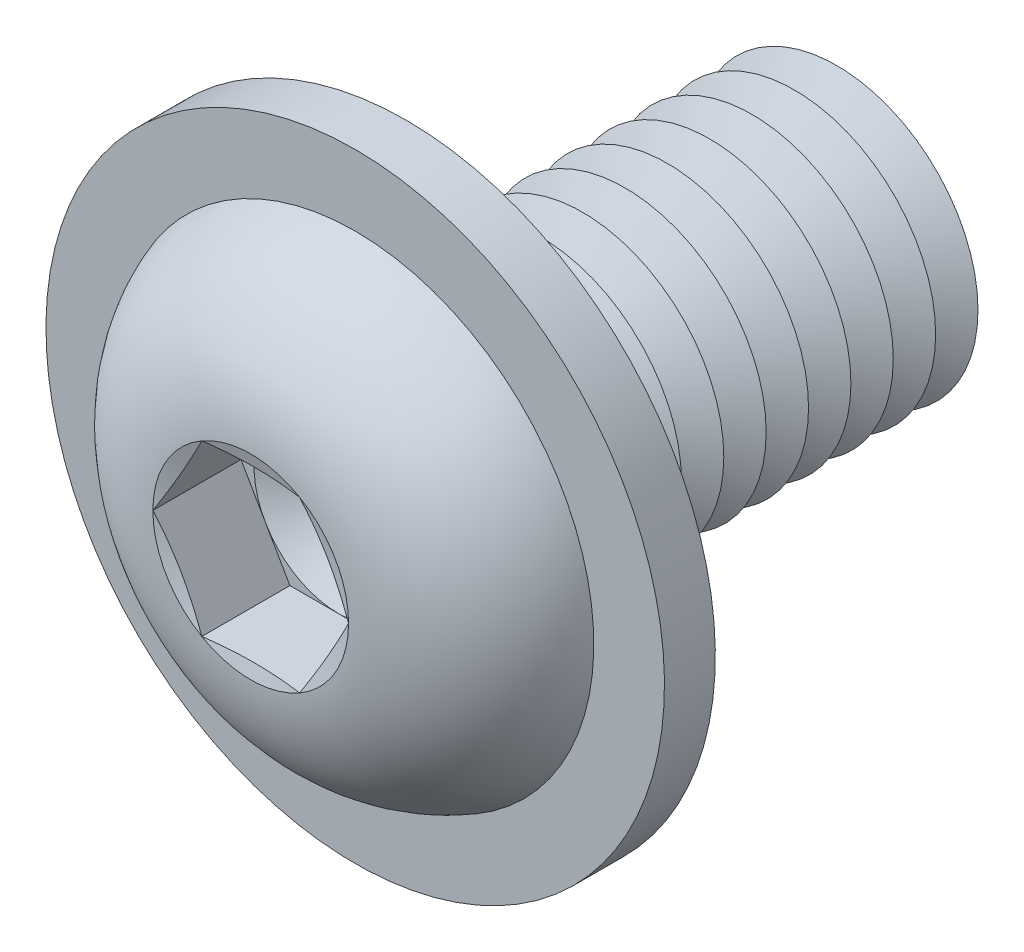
ISO-10303-21;
HEADER;
FILE_DESCRIPTION(('STEP AP214'),'2;1');
FILE_NAME('part.step','',(''),(''),'','','');
FILE_SCHEMA(('AUTOMOTIVE_DESIGN { 1 0 10303 214 1 1 1 1 }'));
ENDSEC;
DATA;
#1=APPLICATION_CONTEXT('core data for automotive mechanical design processes');
#2=APPLICATION_PROTOCOL_DEFINITION('international standard','automotive_design',2000,#1);
#3=PRODUCT_CONTEXT('',#1,'mechanical');
#4=PRODUCT('Part','Part','',(#3));
#5=PRODUCT_RELATED_PRODUCT_CATEGORY('part','',(#4));
#6=PRODUCT_DEFINITION_FORMATION('','',#4);
#7=PRODUCT_DEFINITION_CONTEXT('part definition',#1,'design');
#8=PRODUCT_DEFINITION('design','',#6,#7);
#9=PRODUCT_DEFINITION_SHAPE('','',#8);
#10=(LENGTH_UNIT() NAMED_UNIT(*) SI_UNIT(.MILLI.,.METRE.));
#11=(NAMED_UNIT(*) PLANE_ANGLE_UNIT() SI_UNIT($,.RADIAN.));
#12=(NAMED_UNIT(*) SI_UNIT($,.STERADIAN.) SOLID_ANGLE_UNIT());
#13=UNCERTAINTY_MEASURE_WITH_UNIT(LENGTH_MEASURE(1.E-05),#10,'distance_accuracy_value','');
#14=(GEOMETRIC_REPRESENTATION_CONTEXT(3) GLOBAL_UNCERTAINTY_ASSIGNED_CONTEXT((#13)) GLOBAL_UNIT_ASSIGNED_CONTEXT((#10,
#11,#12)) REPRESENTATION_CONTEXT('',''));
#15=CARTESIAN_POINT('',(0.,0.,0.));
#16=DIRECTION('',(0.,0.,1.));
#17=DIRECTION('',(1.,0.,0.));
#18=AXIS2_PLACEMENT_3D('',#15,#16,#17);
#19=CARTESIAN_POINT('',(0.,0.,-10.75));
#20=DIRECTION('',(0.,0.,1.));
#21=DIRECTION('',(1.,0.,0.));
#22=AXIS2_PLACEMENT_3D('',#19,#20,#21);
#23=CONICAL_SURFACE('',#22,5.,1.0471975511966);
#24=CARTESIAN_POINT('',(0.,0.,-11.5));
#25=DIRECTION('',(0.,0.,1.));
#26=DIRECTION('',(1.,0.,0.));
#27=AXIS2_PLACEMENT_3D('',#24,#25,#26);
#28=CIRCLE('',#27,3.70096189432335);
#29=CARTESIAN_POINT('',(3.70096189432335,0.,-11.5));
#30=VERTEX_POINT('',#29);
#31=EDGE_CURVE('E338',#30,#30,#28,.T.);
#32=ORIENTED_EDGE('',*,*,#31,.T.);
#33=EDGE_LOOP('',(#32));
#34=FACE_BOUND('',#33,.T.);
#35=CARTESIAN_POINT('',(0.,0.,-10.75));
#36=DIRECTION('',(0.,0.,1.));
#37=DIRECTION('',(1.,0.,0.));
#38=AXIS2_PLACEMENT_3D('',#35,#36,#37);
#39=CIRCLE('',#38,5.);
#40=CARTESIAN_POINT('',(5.,0.,-10.75));
#41=VERTEX_POINT('',#40);
#42=EDGE_CURVE('E336',#41,#41,#39,.T.);
#43=ORIENTED_EDGE('',*,*,#42,.F.);
#44=EDGE_LOOP('',(#43));
#45=FACE_BOUND('',#44,.T.);
#46=ADVANCED_FACE('F39',(#34,#45),#23,.T.);
#47=CARTESIAN_POINT('',(0.,0.,-11.5));
#48=DIRECTION('',(0.,0.,-1.));
#49=DIRECTION('',(-1.,0.,0.));
#50=AXIS2_PLACEMENT_3D('',#47,#48,#49);
#51=CONICAL_SURFACE('',#50,3.70096189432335,1.0471975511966);
#52=CARTESIAN_POINT('',(0.,0.,-12.25));
#53=DIRECTION('',(0.,0.,1.));
#54=DIRECTION('',(1.,0.,0.));
#55=AXIS2_PLACEMENT_3D('',#52,#53,#54);
#56=CIRCLE('',#55,5.);
#57=CARTESIAN_POINT('',(5.,0.,-12.25));
#58=VERTEX_POINT('',#57);
#59=EDGE_CURVE('E334',#58,#58,#56,.T.);
#60=ORIENTED_EDGE('',*,*,#59,.T.);
#61=EDGE_LOOP('',(#60));
#62=FACE_BOUND('',#61,.T.);
#63=ORIENTED_EDGE('',*,*,#31,.F.);
#64=EDGE_LOOP('',(#63));
#65=FACE_BOUND('',#64,.T.);
#66=ADVANCED_FACE('F420',(#62,#65),#51,.T.);
#67=CARTESIAN_POINT('',(0.,5.00000000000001,-16.));
#68=DIRECTION('',(0.,0.,-1.));
#69=DIRECTION('',(-1.,0.,0.));
#70=AXIS2_PLACEMENT_3D('',#67,#68,#69);
#71=PLANE('',#70);
#72=CARTESIAN_POINT('',(0.,0.,-16.));
#73=DIRECTION('',(0.,0.,1.));
#74=DIRECTION('',(1.,0.,0.));
#75=AXIS2_PLACEMENT_3D('',#72,#73,#74);
#76=CIRCLE('',#75,3.70096189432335);
#77=CARTESIAN_POINT('',(3.70096189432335,0.,-16.));
#78=VERTEX_POINT('',#77);
#79=EDGE_CURVE('E307',#78,#78,#76,.T.);
#80=ORIENTED_EDGE('',*,*,#79,.F.);
#81=EDGE_LOOP('',(#80));
#82=FACE_BOUND('',#81,.T.);
#83=ADVANCED_FACE('F418',(#82),#71,.T.);
#84=CARTESIAN_POINT('',(0.,0.,-15.25));
#85=DIRECTION('',(0.,0.,1.));
#86=DIRECTION('',(1.,0.,0.));
#87=AXIS2_PLACEMENT_3D('',#84,#85,#86);
#88=CONICAL_SURFACE('',#87,5.,1.0471975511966);
#89=ORIENTED_EDGE('',*,*,#79,.T.);
#90=EDGE_LOOP('',(#89));
#91=FACE_BOUND('',#90,.T.);
#92=CARTESIAN_POINT('',(0.,0.,-15.25));
#93=DIRECTION('',(0.,0.,1.));
#94=DIRECTION('',(1.,0.,0.));
#95=AXIS2_PLACEMENT_3D('',#92,#93,#94);
#96=CIRCLE('',#95,5.);
#97=CARTESIAN_POINT('',(5.,0.,-15.25));
#98=VERTEX_POINT('',#97);
#99=EDGE_CURVE('E354',#98,#98,#96,.T.);
#100=ORIENTED_EDGE('',*,*,#99,.F.);
#101=EDGE_LOOP('',(#100));
#102=FACE_BOUND('',#101,.T.);
#103=ADVANCED_FACE('F415',(#91,#102),#88,.T.);
#104=CARTESIAN_POINT('',(0.,0.,-14.5));
#105=DIRECTION('',(0.,0.,-1.));
#106=DIRECTION('',(-1.,0.,0.));
#107=AXIS2_PLACEMENT_3D('',#104,#105,#106);
#108=CONICAL_SURFACE('',#107,3.70096189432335,1.0471975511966);
#109=ORIENTED_EDGE('',*,*,#99,.T.);
#110=EDGE_LOOP('',(#109));
#111=FACE_BOUND('',#110,.T.);
#112=CARTESIAN_POINT('',(0.,0.,-14.5));
#113=DIRECTION('',(0.,0.,1.));
#114=DIRECTION('',(1.,0.,0.));
#115=AXIS2_PLACEMENT_3D('',#112,#113,#114);
#116=CIRCLE('',#115,3.70096189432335);
#117=CARTESIAN_POINT('',(3.70096189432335,0.,-14.5));
#118=VERTEX_POINT('',#117);
#119=EDGE_CURVE('E351',#118,#118,#116,.T.);
#120=ORIENTED_EDGE('',*,*,#119,.F.);
#121=EDGE_LOOP('',(#120));
#122=FACE_BOUND('',#121,.T.);
#123=ADVANCED_FACE('F425',(#111,#122),#108,.T.);
#124=CARTESIAN_POINT('',(0.,0.,-13.75));
#125=DIRECTION('',(0.,0.,1.));
#126=DIRECTION('',(1.,0.,0.));
#127=AXIS2_PLACEMENT_3D('',#124,#125,#126);
#128=CONICAL_SURFACE('',#127,5.,1.0471975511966);
#129=ORIENTED_EDGE('',*,*,#119,.T.);
#130=EDGE_LOOP('',(#129));
#131=FACE_BOUND('',#130,.T.);
#132=CARTESIAN_POINT('',(0.,0.,-13.75));
#133=DIRECTION('',(0.,0.,1.));
#134=DIRECTION('',(1.,0.,0.));
#135=AXIS2_PLACEMENT_3D('',#132,#133,#134);
#136=CIRCLE('',#135,5.);
#137=CARTESIAN_POINT('',(5.,0.,-13.75));
#138=VERTEX_POINT('',#137);
#139=EDGE_CURVE('E333',#138,#138,#136,.T.);
#140=ORIENTED_EDGE('',*,*,#139,.F.);
#141=EDGE_LOOP('',(#140));
#142=FACE_BOUND('',#141,.T.);
#143=ADVANCED_FACE('F441',(#131,#142),#128,.T.);
#144=CARTESIAN_POINT('',(0.,0.,-13.));
#145=DIRECTION('',(0.,0.,-1.));
#146=DIRECTION('',(-1.,0.,0.));
#147=AXIS2_PLACEMENT_3D('',#144,#145,#146);
#148=CONICAL_SURFACE('',#147,3.70096189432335,1.0471975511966);
#149=ORIENTED_EDGE('',*,*,#139,.T.);
#150=EDGE_LOOP('',(#149));
#151=FACE_BOUND('',#150,.T.);
#152=CARTESIAN_POINT('',(0.,0.,-13.));
#153=DIRECTION('',(0.,0.,1.));
#154=DIRECTION('',(1.,0.,0.));
#155=AXIS2_PLACEMENT_3D('',#152,#153,#154);
#156=CIRCLE('',#155,3.70096189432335);
#157=CARTESIAN_POINT('',(3.70096189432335,0.,-13.));
#158=VERTEX_POINT('',#157);
#159=EDGE_CURVE('E330',#158,#158,#156,.T.);
#160=ORIENTED_EDGE('',*,*,#159,.F.);
#161=EDGE_LOOP('',(#160));
#162=FACE_BOUND('',#161,.T.);
#163=ADVANCED_FACE('F437',(#151,#162),#148,.T.);
#164=CARTESIAN_POINT('',(0.,0.,-12.25));
#165=DIRECTION('',(0.,0.,1.));
#166=DIRECTION('',(1.,0.,0.));
#167=AXIS2_PLACEMENT_3D('',#164,#165,#166);
#168=CONICAL_SURFACE('',#167,5.,1.0471975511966);
#169=ORIENTED_EDGE('',*,*,#159,.T.);
#170=EDGE_LOOP('',(#169));
#171=FACE_BOUND('',#170,.T.);
#172=ORIENTED_EDGE('',*,*,#59,.F.);
#173=EDGE_LOOP('',(#172));
#174=FACE_BOUND('',#173,.T.);
#175=ADVANCED_FACE('F440',(#171,#174),#168,.T.);
#176=CARTESIAN_POINT('',(0.,0.,-9.25));
#177=DIRECTION('',(0.,0.,1.));
#178=DIRECTION('',(1.,0.,0.));
#179=AXIS2_PLACEMENT_3D('',#176,#177,#178);
#180=CONICAL_SURFACE('',#179,5.,1.0471975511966);
#181=CARTESIAN_POINT('',(0.,0.,-10.));
#182=DIRECTION('',(0.,0.,1.));
#183=DIRECTION('',(1.,0.,0.));
#184=AXIS2_PLACEMENT_3D('',#181,#182,#183);
#185=CIRCLE('',#184,3.70096189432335);
#186=CARTESIAN_POINT('',(3.70096189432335,0.,-10.));
#187=VERTEX_POINT('',#186);
#188=EDGE_CURVE('E339',#187,#187,#185,.T.);
#189=ORIENTED_EDGE('',*,*,#188,.T.);
#190=EDGE_LOOP('',(#189));
#191=FACE_BOUND('',#190,.T.);
#192=CARTESIAN_POINT('',(0.,0.,-9.25));
#193=DIRECTION('',(0.,0.,1.));
#194=DIRECTION('',(1.,0.,0.));
#195=AXIS2_PLACEMENT_3D('',#192,#193,#194);
#196=CIRCLE('',#195,5.);
#197=CARTESIAN_POINT('',(5.,0.,-9.25));
#198=VERTEX_POINT('',#197);
#199=EDGE_CURVE('E369',#198,#198,#196,.T.);
#200=ORIENTED_EDGE('',*,*,#199,.F.);
#201=EDGE_LOOP('',(#200));
#202=FACE_BOUND('',#201,.T.);
#203=ADVANCED_FACE('F445',(#191,#202),#180,.T.);
#204=CARTESIAN_POINT('',(0.,0.,-10.));
#205=DIRECTION('',(0.,0.,-1.));
#206=DIRECTION('',(-1.,0.,0.));
#207=AXIS2_PLACEMENT_3D('',#204,#205,#206);
#208=CONICAL_SURFACE('',#207,3.70096189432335,1.0471975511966);
#209=ORIENTED_EDGE('',*,*,#42,.T.);
#210=EDGE_LOOP('',(#209));
#211=FACE_BOUND('',#210,.T.);
#212=ORIENTED_EDGE('',*,*,#188,.F.);
#213=EDGE_LOOP('',(#212));
#214=FACE_BOUND('',#213,.T.);
#215=ADVANCED_FACE('F476',(#211,#214),#208,.T.);
#216=CARTESIAN_POINT('',(0.,0.,-7.75));
#217=DIRECTION('',(0.,0.,1.));
#218=DIRECTION('',(1.,0.,0.));
#219=AXIS2_PLACEMENT_3D('',#216,#217,#218);
#220=CONICAL_SURFACE('',#219,5.,1.0471975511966);
#221=CARTESIAN_POINT('',(0.,0.,-8.5));
#222=DIRECTION('',(0.,0.,1.));
#223=DIRECTION('',(1.,0.,0.));
#224=AXIS2_PLACEMENT_3D('',#221,#222,#223);
#225=CIRCLE('',#224,3.70096189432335);
#226=CARTESIAN_POINT('',(3.70096189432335,0.,-8.5));
#227=VERTEX_POINT('',#226);
#228=EDGE_CURVE('E371',#227,#227,#225,.T.);
#229=ORIENTED_EDGE('',*,*,#228,.T.);
#230=EDGE_LOOP('',(#229));
#231=FACE_BOUND('',#230,.T.);
#232=CARTESIAN_POINT('',(0.,0.,-7.75));
#233=DIRECTION('',(0.,0.,1.));
#234=DIRECTION('',(1.,0.,0.));
#235=AXIS2_PLACEMENT_3D('',#232,#233,#234);
#236=CIRCLE('',#235,5.);
#237=CARTESIAN_POINT('',(5.,0.,-7.75));
#238=VERTEX_POINT('',#237);
#239=EDGE_CURVE('E348',#238,#238,#236,.T.);
#240=ORIENTED_EDGE('',*,*,#239,.F.);
#241=EDGE_LOOP('',(#240));
#242=FACE_BOUND('',#241,.T.);
#243=ADVANCED_FACE('F482',(#231,#242),#220,.T.);
#244=CARTESIAN_POINT('',(0.,0.,-8.5));
#245=DIRECTION('',(0.,0.,-1.));
#246=DIRECTION('',(-1.,0.,0.));
#247=AXIS2_PLACEMENT_3D('',#244,#245,#246);
#248=CONICAL_SURFACE('',#247,3.70096189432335,1.0471975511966);
#249=ORIENTED_EDGE('',*,*,#199,.T.);
#250=EDGE_LOOP('',(#249));
#251=FACE_BOUND('',#250,.T.);
#252=ORIENTED_EDGE('',*,*,#228,.F.);
#253=EDGE_LOOP('',(#252));
#254=FACE_BOUND('',#253,.T.);
#255=ADVANCED_FACE('F489',(#251,#254),#248,.T.);
#256=CARTESIAN_POINT('',(0.,0.,-6.25));
#257=DIRECTION('',(0.,0.,1.));
#258=DIRECTION('',(1.,0.,0.));
#259=AXIS2_PLACEMENT_3D('',#256,#257,#258);
#260=CONICAL_SURFACE('',#259,5.,1.0471975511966);
#261=CARTESIAN_POINT('',(0.,0.,-7.));
#262=DIRECTION('',(0.,0.,1.));
#263=DIRECTION('',(1.,0.,0.));
#264=AXIS2_PLACEMENT_3D('',#261,#262,#263);
#265=CIRCLE('',#264,3.70096189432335);
#266=CARTESIAN_POINT('',(3.70096189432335,0.,-7.));
#267=VERTEX_POINT('',#266);
#268=EDGE_CURVE('E345',#267,#267,#265,.T.);
#269=ORIENTED_EDGE('',*,*,#268,.T.);
#270=EDGE_LOOP('',(#269));
#271=FACE_BOUND('',#270,.T.);
#272=CARTESIAN_POINT('',(0.,0.,-6.25));
#273=DIRECTION('',(0.,0.,1.));
#274=DIRECTION('',(1.,0.,0.));
#275=AXIS2_PLACEMENT_3D('',#272,#273,#274);
#276=CIRCLE('',#275,5.);
#277=CARTESIAN_POINT('',(5.,0.,-6.25));
#278=VERTEX_POINT('',#277);
#279=EDGE_CURVE('E349',#278,#278,#276,.T.);
#280=ORIENTED_EDGE('',*,*,#279,.F.);
#281=EDGE_LOOP('',(#280));
#282=FACE_BOUND('',#281,.T.);
#283=ADVANCED_FACE('F496',(#271,#282),#260,.T.);
#284=CARTESIAN_POINT('',(0.,0.,-7.));
#285=DIRECTION('',(0.,0.,-1.));
#286=DIRECTION('',(-1.,0.,0.));
#287=AXIS2_PLACEMENT_3D('',#284,#285,#286);
#288=CONICAL_SURFACE('',#287,3.70096189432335,1.0471975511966);
#289=ORIENTED_EDGE('',*,*,#239,.T.);
#290=EDGE_LOOP('',(#289));
#291=FACE_BOUND('',#290,.T.);
#292=ORIENTED_EDGE('',*,*,#268,.F.);
#293=EDGE_LOOP('',(#292));
#294=FACE_BOUND('',#293,.T.);
#295=ADVANCED_FACE('F503',(#291,#294),#288,.T.);
#296=CARTESIAN_POINT('',(0.,0.,-4.75));
#297=DIRECTION('',(0.,0.,1.));
#298=DIRECTION('',(1.,0.,0.));
#299=AXIS2_PLACEMENT_3D('',#296,#297,#298);
#300=CONICAL_SURFACE('',#299,5.,1.0471975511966);
#301=CARTESIAN_POINT('',(0.,0.,-5.5));
#302=DIRECTION('',(0.,0.,1.));
#303=DIRECTION('',(1.,0.,0.));
#304=AXIS2_PLACEMENT_3D('',#301,#302,#303);
#305=CIRCLE('',#304,3.70096189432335);
#306=CARTESIAN_POINT('',(3.70096189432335,0.,-5.5));
#307=VERTEX_POINT('',#306);
#308=EDGE_CURVE('E380',#307,#307,#305,.T.);
#309=ORIENTED_EDGE('',*,*,#308,.T.);
#310=EDGE_LOOP('',(#309));
#311=FACE_BOUND('',#310,.T.);
#312=CARTESIAN_POINT('',(0.,0.,-4.75));
#313=DIRECTION('',(0.,0.,1.));
#314=DIRECTION('',(1.,0.,0.));
#315=AXIS2_PLACEMENT_3D('',#312,#313,#314);
#316=CIRCLE('',#315,5.);
#317=CARTESIAN_POINT('',(5.,0.,-4.75));
#318=VERTEX_POINT('',#317);
#319=EDGE_CURVE('E382',#318,#318,#316,.T.);
#320=ORIENTED_EDGE('',*,*,#319,.F.);
#321=EDGE_LOOP('',(#320));
#322=FACE_BOUND('',#321,.T.);
#323=ADVANCED_FACE('F510',(#311,#322),#300,.T.);
#324=CARTESIAN_POINT('',(0.,0.,-5.5));
#325=DIRECTION('',(0.,0.,-1.));
#326=DIRECTION('',(-1.,0.,0.));
#327=AXIS2_PLACEMENT_3D('',#324,#325,#326);
#328=CONICAL_SURFACE('',#327,3.70096189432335,1.0471975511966);
#329=ORIENTED_EDGE('',*,*,#279,.T.);
#330=EDGE_LOOP('',(#329));
#331=FACE_BOUND('',#330,.T.);
#332=ORIENTED_EDGE('',*,*,#308,.F.);
#333=EDGE_LOOP('',(#332));
#334=FACE_BOUND('',#333,.T.);
#335=ADVANCED_FACE('F517',(#331,#334),#328,.T.);
#336=CARTESIAN_POINT('',(0.,0.,-3.25));
#337=DIRECTION('',(0.,0.,1.));
#338=DIRECTION('',(1.,0.,0.));
#339=AXIS2_PLACEMENT_3D('',#336,#337,#338);
#340=CONICAL_SURFACE('',#339,5.,1.0471975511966);
#341=CARTESIAN_POINT('',(0.,0.,-4.));
#342=DIRECTION('',(0.,0.,1.));
#343=DIRECTION('',(1.,0.,0.));
#344=AXIS2_PLACEMENT_3D('',#341,#342,#343);
#345=CIRCLE('',#344,3.70096189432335);
#346=CARTESIAN_POINT('',(3.70096189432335,0.,-4.));
#347=VERTEX_POINT('',#346);
#348=EDGE_CURVE('E390',#347,#347,#345,.T.);
#349=ORIENTED_EDGE('',*,*,#348,.T.);
#350=EDGE_LOOP('',(#349));
#351=FACE_BOUND('',#350,.T.);
#352=CARTESIAN_POINT('',(0.,0.,-3.25));
#353=DIRECTION('',(0.,0.,1.));
#354=DIRECTION('',(1.,0.,0.));
#355=AXIS2_PLACEMENT_3D('',#352,#353,#354);
#356=CIRCLE('',#355,5.);
#357=CARTESIAN_POINT('',(5.,0.,-3.25));
#358=VERTEX_POINT('',#357);
#359=EDGE_CURVE('E358',#358,#358,#356,.T.);
#360=ORIENTED_EDGE('',*,*,#359,.F.);
#361=EDGE_LOOP('',(#360));
#362=FACE_BOUND('',#361,.T.);
#363=ADVANCED_FACE('F523',(#351,#362),#340,.T.);
#364=CARTESIAN_POINT('',(0.,0.,-4.));
#365=DIRECTION('',(0.,0.,-1.));
#366=DIRECTION('',(-1.,0.,0.));
#367=AXIS2_PLACEMENT_3D('',#364,#365,#366);
#368=CONICAL_SURFACE('',#367,3.70096189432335,1.0471975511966);
#369=ORIENTED_EDGE('',*,*,#319,.T.);
#370=EDGE_LOOP('',(#369));
#371=FACE_BOUND('',#370,.T.);
#372=ORIENTED_EDGE('',*,*,#348,.F.);
#373=EDGE_LOOP('',(#372));
#374=FACE_BOUND('',#373,.T.);
#375=ADVANCED_FACE('F530',(#371,#374),#368,.T.);
#376=CARTESIAN_POINT('',(0.,0.,-1.75));
#377=DIRECTION('',(0.,0.,1.));
#378=DIRECTION('',(1.,0.,0.));
#379=AXIS2_PLACEMENT_3D('',#376,#377,#378);
#380=CONICAL_SURFACE('',#379,5.,1.0471975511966);
#381=CARTESIAN_POINT('',(0.,0.,-2.5));
#382=DIRECTION('',(0.,0.,1.));
#383=DIRECTION('',(1.,0.,0.));
#384=AXIS2_PLACEMENT_3D('',#381,#382,#383);
#385=CIRCLE('',#384,3.70096189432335);
#386=CARTESIAN_POINT('',(3.70096189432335,0.,-2.5));
#387=VERTEX_POINT('',#386);
#388=EDGE_CURVE('E227',#387,#387,#385,.T.);
#389=ORIENTED_EDGE('',*,*,#388,.T.);
#390=EDGE_LOOP('',(#389));
#391=FACE_BOUND('',#390,.T.);
#392=CARTESIAN_POINT('',(0.,0.,-1.75));
#393=DIRECTION('',(0.,0.,1.));
#394=DIRECTION('',(1.,0.,0.));
#395=AXIS2_PLACEMENT_3D('',#392,#393,#394);
#396=CIRCLE('',#395,5.);
#397=CARTESIAN_POINT('',(5.,0.,-1.75));
#398=VERTEX_POINT('',#397);
#399=EDGE_CURVE('E360',#398,#398,#396,.T.);
#400=ORIENTED_EDGE('',*,*,#399,.F.);
#401=EDGE_LOOP('',(#400));
#402=FACE_BOUND('',#401,.T.);
#403=ADVANCED_FACE('F537',(#391,#402),#380,.T.);
#404=CARTESIAN_POINT('',(0.,0.,-2.5));
#405=DIRECTION('',(0.,0.,-1.));
#406=DIRECTION('',(-1.,0.,0.));
#407=AXIS2_PLACEMENT_3D('',#404,#405,#406);
#408=CONICAL_SURFACE('',#407,3.70096189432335,1.0471975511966);
#409=ORIENTED_EDGE('',*,*,#359,.T.);
#410=EDGE_LOOP('',(#409));
#411=FACE_BOUND('',#410,.T.);
#412=ORIENTED_EDGE('',*,*,#388,.F.);
#413=EDGE_LOOP('',(#412));
#414=FACE_BOUND('',#413,.T.);
#415=ADVANCED_FACE('F211',(#411,#414),#408,.T.);
#416=CARTESIAN_POINT('',(0.,5.,0.));
#417=DIRECTION('',(0.,0.,-1.));
#418=DIRECTION('',(-1.,0.,0.));
#419=AXIS2_PLACEMENT_3D('',#416,#417,#418);
#420=PLANE('',#419);
#421=CARTESIAN_POINT('',(0.,0.,0.));
#422=DIRECTION('',(0.,0.,-1.));
#423=DIRECTION('',(-1.,0.,0.));
#424=AXIS2_PLACEMENT_3D('',#421,#422,#423);
#425=CIRCLE('',#424,5.75);
#426=CARTESIAN_POINT('',(-5.75,0.,0.));
#427=VERTEX_POINT('',#426);
#428=EDGE_CURVE('E282',#427,#427,#425,.F.);
#429=ORIENTED_EDGE('',*,*,#428,.T.);
#430=EDGE_LOOP('',(#429));
#431=FACE_BOUND('',#430,.T.);
#432=CARTESIAN_POINT('',(0.,0.,0.));
#433=DIRECTION('',(0.,0.,-1.));
#434=DIRECTION('',(0.,1.,0.));
#435=AXIS2_PLACEMENT_3D('',#432,#433,#434);
#436=CIRCLE('',#435,10.95);
#437=CARTESIAN_POINT('',(0.,10.95,0.));
#438=VERTEX_POINT('',#437);
#439=EDGE_CURVE('E363',#438,#438,#436,.T.);
#440=ORIENTED_EDGE('',*,*,#439,.T.);
#441=EDGE_LOOP('',(#440));
#442=FACE_BOUND('',#441,.T.);
#443=ADVANCED_FACE('F549',(#431,#442),#420,.T.);
#444=CARTESIAN_POINT('',(0.,0.,-0.749999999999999));
#445=DIRECTION('',(0.,0.,-1.));
#446=DIRECTION('',(-1.,0.,0.));
#447=AXIS2_PLACEMENT_3D('',#444,#445,#446);
#448=TOROIDAL_SURFACE('',#447,5.75,0.75);
#449=ORIENTED_EDGE('',*,*,#428,.F.);
#450=EDGE_LOOP('',(#449));
#451=FACE_BOUND('',#450,.T.);
#452=CARTESIAN_POINT('',(0.,0.,-0.749999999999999));
#453=DIRECTION('',(0.,0.,-1.));
#454=DIRECTION('',(-1.,0.,0.));
#455=AXIS2_PLACEMENT_3D('',#452,#453,#454);
#456=CIRCLE('',#455,5.);
#457=CARTESIAN_POINT('',(-5.,0.,-0.749999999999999));
#458=VERTEX_POINT('',#457);
#459=EDGE_CURVE('E289',#458,#458,#456,.T.);
#460=ORIENTED_EDGE('',*,*,#459,.F.);
#461=EDGE_LOOP('',(#460));
#462=FACE_BOUND('',#461,.T.);
#463=ADVANCED_FACE('F41',(#451,#462),#448,.F.);
#464=CARTESIAN_POINT('',(0.,0.,-16.));
#465=DIRECTION('',(0.,0.,-1.));
#466=DIRECTION('',(-1.,0.,0.));
#467=AXIS2_PLACEMENT_3D('',#464,#465,#466);
#468=CYLINDRICAL_SURFACE('',#467,5.);
#469=ORIENTED_EDGE('',*,*,#459,.T.);
#470=EDGE_LOOP('',(#469));
#471=FACE_BOUND('',#470,.T.);
#472=ORIENTED_EDGE('',*,*,#399,.T.);
#473=EDGE_LOOP('',(#472));
#474=FACE_BOUND('',#473,.T.);
#475=ADVANCED_FACE('F560',(#471,#474),#468,.T.);
#476=CARTESIAN_POINT('',(0.,0.,1.8));
#477=DIRECTION('',(0.,0.,-1.));
#478=DIRECTION('',(0.,1.,0.));
#479=AXIS2_PLACEMENT_3D('',#476,#477,#478);
#480=CYLINDRICAL_SURFACE('',#479,10.95);
#481=CARTESIAN_POINT('',(0.,0.,1.8));
#482=DIRECTION('',(0.,0.,-1.));
#483=DIRECTION('',(0.,1.,0.));
#484=AXIS2_PLACEMENT_3D('',#481,#482,#483);
#485=CIRCLE('',#484,10.95);
#486=CARTESIAN_POINT('',(0.,10.95,1.8));
#487=VERTEX_POINT('',#486);
#488=EDGE_CURVE('E365',#487,#487,#485,.T.);
#489=ORIENTED_EDGE('',*,*,#488,.T.);
#490=EDGE_LOOP('',(#489));
#491=FACE_BOUND('',#490,.T.);
#492=ORIENTED_EDGE('',*,*,#439,.F.);
#493=EDGE_LOOP('',(#492));
#494=FACE_BOUND('',#493,.T.);
#495=ADVANCED_FACE('F566',(#491,#494),#480,.T.);
#496=CARTESIAN_POINT('',(0.,0.,1.8));
#497=DIRECTION('',(0.,0.,-1.));
#498=DIRECTION('',(0.,1.,0.));
#499=AXIS2_PLACEMENT_3D('',#496,#497,#498);
#500=PLANE('',#499);
#501=CARTESIAN_POINT('',(0.,0.,1.8));
#502=DIRECTION('',(0.,0.,-1.));
#503=DIRECTION('',(0.,1.,0.));
#504=AXIS2_PLACEMENT_3D('',#501,#502,#503);
#505=CIRCLE('',#504,8.44736706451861);
#506=CARTESIAN_POINT('',(0.,8.44736706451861,1.8));
#507=VERTEX_POINT('',#506);
#508=EDGE_CURVE('E43',#507,#507,#505,.F.);
#509=ORIENTED_EDGE('',*,*,#508,.F.);
#510=EDGE_LOOP('',(#509));
#511=FACE_BOUND('',#510,.T.);
#512=ORIENTED_EDGE('',*,*,#488,.F.);
#513=EDGE_LOOP('',(#512));
#514=FACE_BOUND('',#513,.T.);
#515=ADVANCED_FACE('F117',(#511,#514),#500,.F.);
#516=CARTESIAN_POINT('',(0.,0.,2.38));
#517=DIRECTION('',(0.,0.,1.));
#518=DIRECTION('',(1.,0.,0.));
#519=AXIS2_PLACEMENT_3D('',#516,#517,#518);
#520=CONICAL_SURFACE('',#519,2.99999860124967,1.0471975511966);
#521=CARTESIAN_POINT('',(0.,0.,0.64795000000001));
#522=VERTEX_POINT('',#521);
#523=VERTEX_LOOP('',#522);
#524=FACE_BOUND('',#523,.T.);
#525=CARTESIAN_POINT('',(0.,0.,2.38));
#526=DIRECTION('',(0.,0.,1.));
#527=DIRECTION('',(1.,0.,0.));
#528=AXIS2_PLACEMENT_3D('',#525,#526,#527);
#529=CIRCLE('',#528,2.99999860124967);
#530=CARTESIAN_POINT('',(2.598075,1.49999930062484,2.38));
#531=VERTEX_POINT('',#530);
#532=CARTESIAN_POINT('',(0.,2.99999860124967,2.38));
#533=VERTEX_POINT('',#532);
#534=EDGE_CURVE('E120',#531,#533,#529,.T.);
#535=ORIENTED_EDGE('',*,*,#534,.T.);
#536=CARTESIAN_POINT('',(0.,0.,2.38));
#537=DIRECTION('',(0.,0.,1.));
#538=DIRECTION('',(1.,0.,0.));
#539=AXIS2_PLACEMENT_3D('',#536,#537,#538);
#540=CIRCLE('',#539,2.99999860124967);
#541=CARTESIAN_POINT('',(-2.598075,1.49999930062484,2.38));
#542=VERTEX_POINT('',#541);
#543=EDGE_CURVE('E11',#533,#542,#540,.T.);
#544=ORIENTED_EDGE('',*,*,#543,.T.);
#545=CARTESIAN_POINT('',(-2.598075,-1.49999930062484,2.38));
#546=VERTEX_POINT('',#545);
#547=EDGE_CURVE('E49',#542,#546,#540,.T.);
#548=ORIENTED_EDGE('',*,*,#547,.T.);
#549=CARTESIAN_POINT('',(0.,-2.99999860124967,2.38));
#550=VERTEX_POINT('',#549);
#551=EDGE_CURVE('E286',#546,#550,#540,.T.);
#552=ORIENTED_EDGE('',*,*,#551,.T.);
#553=CARTESIAN_POINT('',(2.598075,-1.49999930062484,2.38));
#554=VERTEX_POINT('',#553);
#555=EDGE_CURVE('E57',#550,#554,#540,.T.);
#556=ORIENTED_EDGE('',*,*,#555,.T.);
#557=EDGE_CURVE('E50',#554,#531,#540,.T.);
#558=ORIENTED_EDGE('',*,*,#557,.T.);
#559=EDGE_LOOP('',(#535,#544,#548,#552,#556,#558));
#560=FACE_BOUND('',#559,.T.);
#561=ADVANCED_FACE('F114',(#524,#560),#520,.F.);
#562=CARTESIAN_POINT('',(0.,0.,2.38));
#563=DIRECTION('',(0.,0.,1.));
#564=DIRECTION('',(1.,0.,0.));
#565=AXIS2_PLACEMENT_3D('',#562,#563,#564);
#566=PLANE('',#565);
#567=ORIENTED_EDGE('',*,*,#551,.F.);
#568=DIRECTION('',(0.5,-0.866025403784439,0.));
#569=VECTOR('',#568,1.);
#570=CARTESIAN_POINT('',(-3.4641,0.,2.38));
#571=LINE('',#570,#569);
#572=CARTESIAN_POINT('',(-1.73205,-2.99999860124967,2.38));
#573=VERTEX_POINT('',#572);
#574=EDGE_CURVE('E153',#546,#573,#571,.T.);
#575=ORIENTED_EDGE('',*,*,#574,.T.);
#576=DIRECTION('',(1.,0.,0.));
#577=VECTOR('',#576,1.);
#578=CARTESIAN_POINT('',(-1.73205,-2.99999860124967,2.38));
#579=LINE('',#578,#577);
#580=EDGE_CURVE('E159',#573,#550,#579,.T.);
#581=ORIENTED_EDGE('',*,*,#580,.T.);
#582=EDGE_LOOP('',(#567,#575,#581));
#583=FACE_BOUND('',#582,.T.);
#584=ADVANCED_FACE('F116',(#583),#566,.T.);
#585=ORIENTED_EDGE('',*,*,#555,.F.);
#586=CARTESIAN_POINT('',(1.73205,-2.99999860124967,2.38));
#587=VERTEX_POINT('',#586);
#588=EDGE_CURVE('E158',#550,#587,#579,.T.);
#589=ORIENTED_EDGE('',*,*,#588,.T.);
#590=DIRECTION('',(0.5,0.866025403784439,0.));
#591=VECTOR('',#590,1.);
#592=CARTESIAN_POINT('',(1.73205,-2.99999860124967,2.38));
#593=LINE('',#592,#591);
#594=EDGE_CURVE('E164',#587,#554,#593,.T.);
#595=ORIENTED_EDGE('',*,*,#594,.T.);
#596=EDGE_LOOP('',(#585,#589,#595));
#597=FACE_BOUND('',#596,.T.);
#598=ADVANCED_FACE('F587',(#597),#566,.T.);
#599=ORIENTED_EDGE('',*,*,#557,.F.);
#600=CARTESIAN_POINT('',(3.4641,0.,2.38));
#601=VERTEX_POINT('',#600);
#602=EDGE_CURVE('E163',#554,#601,#593,.T.);
#603=ORIENTED_EDGE('',*,*,#602,.T.);
#604=DIRECTION('',(-0.5,0.866025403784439,0.));
#605=VECTOR('',#604,1.);
#606=CARTESIAN_POINT('',(3.4641,0.,2.38));
#607=LINE('',#606,#605);
#608=EDGE_CURVE('E142',#601,#531,#607,.T.);
#609=ORIENTED_EDGE('',*,*,#608,.T.);
#610=EDGE_LOOP('',(#599,#603,#609));
#611=FACE_BOUND('',#610,.T.);
#612=ADVANCED_FACE('F593',(#611),#566,.T.);
#613=ORIENTED_EDGE('',*,*,#534,.F.);
#614=CARTESIAN_POINT('',(1.73205,2.99999860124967,2.38));
#615=VERTEX_POINT('',#614);
#616=EDGE_CURVE('E127',#531,#615,#607,.T.);
#617=ORIENTED_EDGE('',*,*,#616,.T.);
#618=DIRECTION('',(-1.,0.,0.));
#619=VECTOR('',#618,1.);
#620=CARTESIAN_POINT('',(1.73205,2.99999860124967,2.38));
#621=LINE('',#620,#619);
#622=EDGE_CURVE('E138',#615,#533,#621,.T.);
#623=ORIENTED_EDGE('',*,*,#622,.T.);
#624=EDGE_LOOP('',(#613,#617,#623));
#625=FACE_BOUND('',#624,.T.);
#626=ADVANCED_FACE('F144',(#625),#566,.T.);
#627=ORIENTED_EDGE('',*,*,#543,.F.);
#628=CARTESIAN_POINT('',(-1.73205,2.99999860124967,2.38));
#629=VERTEX_POINT('',#628);
#630=EDGE_CURVE('E133',#533,#629,#621,.T.);
#631=ORIENTED_EDGE('',*,*,#630,.T.);
#632=DIRECTION('',(-0.5,-0.866025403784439,0.));
#633=VECTOR('',#632,1.);
#634=CARTESIAN_POINT('',(-1.73205,2.99999860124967,2.38));
#635=LINE('',#634,#633);
#636=EDGE_CURVE('E136',#629,#542,#635,.T.);
#637=ORIENTED_EDGE('',*,*,#636,.T.);
#638=EDGE_LOOP('',(#627,#631,#637));
#639=FACE_BOUND('',#638,.T.);
#640=ADVANCED_FACE('F132',(#639),#566,.T.);
#641=ORIENTED_EDGE('',*,*,#547,.F.);
#642=CARTESIAN_POINT('',(-3.4641,0.,2.38));
#643=VERTEX_POINT('',#642);
#644=EDGE_CURVE('E146',#542,#643,#635,.T.);
#645=ORIENTED_EDGE('',*,*,#644,.T.);
#646=EDGE_CURVE('E154',#643,#546,#571,.T.);
#647=ORIENTED_EDGE('',*,*,#646,.T.);
#648=EDGE_LOOP('',(#641,#645,#647));
#649=FACE_BOUND('',#648,.T.);
#650=ADVANCED_FACE('F262',(#649),#566,.T.);
#651=CARTESIAN_POINT('',(-3.4641,0.,2.38));
#652=DIRECTION('',(-0.866025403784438,-0.5,0.));
#653=DIRECTION('',(0.5,-0.866025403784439,0.));
#654=AXIS2_PLACEMENT_3D('',#651,#652,#653);
#655=PLANE('',#654);
#656=CARTESIAN_POINT('',(-3.46421547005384,0.000200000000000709,5.50003094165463));
#657=CARTESIAN_POINT('',(-3.39227822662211,-0.12439896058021,5.48074619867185));
#658=CARTESIAN_POINT('',(-3.32021054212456,-0.249223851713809,5.46323875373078));
#659=CARTESIAN_POINT('',(-3.17582062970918,-0.499314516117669,5.43247971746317));
#660=CARTESIAN_POINT('',(-3.10349831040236,-0.624580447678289,5.41922985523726));
#661=CARTESIAN_POINT('',(-2.95903767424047,-0.874793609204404,5.39775958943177));
#662=CARTESIAN_POINT('',(-2.88690033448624,-0.999739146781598,5.38951357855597));
#663=CARTESIAN_POINT('',(-2.74253364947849,-1.24978958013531,5.37845651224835));
#664=CARTESIAN_POINT('',(-2.67030432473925,-1.37489444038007,5.3756444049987));
#665=CARTESIAN_POINT('',(-2.52584567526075,-1.6251041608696,5.3756444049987));
#666=CARTESIAN_POINT('',(-2.45361635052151,-1.75020902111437,5.37845651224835));
#667=CARTESIAN_POINT('',(-2.30924966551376,-2.00025945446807,5.38951357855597));
#668=CARTESIAN_POINT('',(-2.23711232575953,-2.12520499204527,5.39775958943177));
#669=CARTESIAN_POINT('',(-2.09265168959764,-2.37541815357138,5.41922985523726));
#670=CARTESIAN_POINT('',(-2.02032937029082,-2.500684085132,5.43247971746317));
#671=CARTESIAN_POINT('',(-1.87593945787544,-2.75077474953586,5.46323875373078));
#672=CARTESIAN_POINT('',(-1.80387177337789,-2.87559964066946,5.48074619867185));
#673=CARTESIAN_POINT('',(-1.73193452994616,-3.00019860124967,5.50003094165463));
#674=B_SPLINE_CURVE_WITH_KNOTS('',3,(#656,#657,#658,#659,#660,#661,#662,#663,#664,#665,#666,
#667,#668,#669,#670,#671,#672,#673),.UNSPECIFIED.,.F.,.F.,(4,2,2,2,2,2,2,2,4),(0.,
0.435506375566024,0.871189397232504,1.3046235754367,1.7379738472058,2.1713241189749,
2.6047582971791,3.04044131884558,3.4759476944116),.UNSPECIFIED.);
#675=CARTESIAN_POINT('',(-3.4641,0.,5.5));
#676=VERTEX_POINT('',#675);
#677=CARTESIAN_POINT('',(-1.73205,-2.99999860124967,5.5));
#678=VERTEX_POINT('',#677);
#679=EDGE_CURVE('E238',#676,#678,#674,.T.);
#680=ORIENTED_EDGE('',*,*,#679,.T.);
#681=DIRECTION('',(0.,0.,1.));
#682=VECTOR('',#681,1.);
#683=CARTESIAN_POINT('',(-1.73205,-2.99999860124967,2.38));
#684=LINE('',#683,#682);
#685=EDGE_CURVE('E178',#573,#678,#684,.T.);
#686=ORIENTED_EDGE('',*,*,#685,.F.);
#687=ORIENTED_EDGE('',*,*,#574,.F.);
#688=ORIENTED_EDGE('',*,*,#646,.F.);
#689=DIRECTION('',(0.,0.,1.));
#690=VECTOR('',#689,1.);
#691=CARTESIAN_POINT('',(-3.4641,0.,2.38));
#692=LINE('',#691,#690);
#693=EDGE_CURVE('E174',#643,#676,#692,.T.);
#694=ORIENTED_EDGE('',*,*,#693,.T.);
#695=EDGE_LOOP('',(#680,#686,#687,#688,#694));
#696=FACE_BOUND('',#695,.T.);
#697=ADVANCED_FACE('F256',(#696),#655,.F.);
#698=CARTESIAN_POINT('',(-1.73205,-2.99999860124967,2.38));
#699=DIRECTION('',(0.,-1.,0.));
#700=DIRECTION('',(0.,0.,-1.));
#701=AXIS2_PLACEMENT_3D('',#698,#699,#700);
#702=PLANE('',#701);
#703=CARTESIAN_POINT('',(-5.2273006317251,-2.99999860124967,6.18672552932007));
#704=CARTESIAN_POINT('',(-5.10075887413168,-2.99999860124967,6.15732018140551));
#705=CARTESIAN_POINT('',(-4.97415993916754,-2.99999860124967,6.12816064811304));
#706=CARTESIAN_POINT('',(-4.72082394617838,-2.99999860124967,6.07043857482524));
#707=CARTESIAN_POINT('',(-4.59408688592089,-2.99999860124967,6.04187604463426));
#708=CARTESIAN_POINT('',(-4.21358997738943,-2.99999860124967,5.95723252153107));
#709=CARTESIAN_POINT('',(-3.95959339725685,-2.99999860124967,5.90220706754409));
#710=CARTESIAN_POINT('',(-3.44835573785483,-2.99999860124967,5.79574115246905));
#711=CARTESIAN_POINT('',(-3.19110656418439,-2.99999860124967,5.74433913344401));
#712=CARTESIAN_POINT('',(-2.67540790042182,-2.99999860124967,5.6477299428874));
#713=CARTESIAN_POINT('',(-2.41695830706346,-2.99999860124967,5.60252331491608));
#714=CARTESIAN_POINT('',(-1.9055512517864,-2.99999860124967,5.52251897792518));
#715=CARTESIAN_POINT('',(-1.65263426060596,-2.99999860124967,5.48747285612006));
#716=CARTESIAN_POINT('',(-1.27220564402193,-2.99999860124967,5.44439602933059));
#717=CARTESIAN_POINT('',(-1.1452320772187,-2.99999860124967,5.43161987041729));
#718=CARTESIAN_POINT('',(-0.890973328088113,-2.99999860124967,5.40972605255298));
#719=CARTESIAN_POINT('',(-0.76368816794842,-2.99999860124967,5.40060814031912));
#720=CARTESIAN_POINT('',(-0.509442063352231,-2.99999860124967,5.38647457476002));
#721=CARTESIAN_POINT('',(-0.382482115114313,-2.99999860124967,5.38144125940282));
#722=CARTESIAN_POINT('',(-0.128463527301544,-2.99999860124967,5.37566637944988));
#723=CARTESIAN_POINT('',(-0.00140488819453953,-2.99999860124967,5.37492479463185));
#724=CARTESIAN_POINT('',(0.252672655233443,-2.99999860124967,5.37777315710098));
#725=CARTESIAN_POINT('',(0.379691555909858,-2.99999860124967,5.38136342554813));
#726=CARTESIAN_POINT('',(0.63354019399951,-2.99999860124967,5.39268816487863));
#727=CARTESIAN_POINT('',(0.760369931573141,-2.99999860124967,5.40042263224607));
#728=CARTESIAN_POINT('',(1.06836981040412,-2.99999860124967,5.42382465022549));
#729=CARTESIAN_POINT('',(1.24938929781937,-2.99999860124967,5.44147485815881));
#730=CARTESIAN_POINT('',(1.61066786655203,-2.99999860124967,5.48312309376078));
#731=CARTESIAN_POINT('',(1.7909269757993,-2.99999860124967,5.50712088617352));
#732=CARTESIAN_POINT('',(2.15127612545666,-2.99999860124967,5.56013471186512));
#733=CARTESIAN_POINT('',(2.33136383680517,-2.99999860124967,5.58916634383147));
#734=CARTESIAN_POINT('',(2.690892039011,-2.99999860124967,5.65100028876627));
#735=CARTESIAN_POINT('',(2.87033249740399,-2.99999860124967,5.68380278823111));
#736=CARTESIAN_POINT('',(3.23235399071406,-2.99999860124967,5.75295369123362));
#737=CARTESIAN_POINT('',(3.4149236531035,-2.99999860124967,5.78936117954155));
#738=CARTESIAN_POINT('',(3.77960351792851,-2.99999860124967,5.864406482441));
#739=CARTESIAN_POINT('',(3.96171371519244,-2.99999860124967,5.903044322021));
#740=CARTESIAN_POINT('',(4.32457472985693,-2.99999860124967,5.9817966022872));
#741=CARTESIAN_POINT('',(4.5053275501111,-2.99999860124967,6.02190185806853));
#742=CARTESIAN_POINT('',(4.86652484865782,-2.99999860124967,6.10342152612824));
#743=CARTESIAN_POINT('',(5.04696934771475,-2.99999860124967,6.14483584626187));
#744=CARTESIAN_POINT('',(5.2273006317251,-2.99999860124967,6.18672552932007));
#745=B_SPLINE_CURVE_WITH_KNOTS('',3,(#703,#704,#705,#706,#707,#708,#709,#710,#711,#712,#713,
#714,#715,#716,#717,#718,#719,#720,#721,#722,#723,#724,#725,#726,#727,#728,#729,#730,#731,#732,
#733,#734,#735,#736,#737,#738,#739,#740,#741,#742,#743,#744),.UNSPECIFIED.,.F.,.F.,(4,2,2,2,2,2,
2,2,2,2,2,2,2,2,2,2,2,2,2,2,4),(0.,0.389739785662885,0.779485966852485,1.5591292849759,
2.34608117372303,3.13310206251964,3.8988410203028,4.28164148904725,4.66441544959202,
5.04552531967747,5.42663339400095,5.80776972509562,6.18890573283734,6.73438998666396,
7.27985402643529,7.8270395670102,8.37425218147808,8.93272720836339,9.49120849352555,
10.0466490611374,10.6020506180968),.UNSPECIFIED.);
#746=CARTESIAN_POINT('',(1.73205,-2.99999860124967,5.5));
#747=VERTEX_POINT('',#746);
#748=EDGE_CURVE('E243',#678,#747,#745,.T.);
#749=ORIENTED_EDGE('',*,*,#748,.T.);
#750=DIRECTION('',(0.,0.,1.));
#751=VECTOR('',#750,1.);
#752=CARTESIAN_POINT('',(1.73205,-2.99999860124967,2.38));
#753=LINE('',#752,#751);
#754=EDGE_CURVE('E173',#587,#747,#753,.T.);
#755=ORIENTED_EDGE('',*,*,#754,.F.);
#756=ORIENTED_EDGE('',*,*,#588,.F.);
#757=ORIENTED_EDGE('',*,*,#580,.F.);
#758=ORIENTED_EDGE('',*,*,#685,.T.);
#759=EDGE_LOOP('',(#749,#755,#756,#757,#758));
#760=FACE_BOUND('',#759,.T.);
#761=ADVANCED_FACE('F253',(#760),#702,.F.);
#762=CARTESIAN_POINT('',(1.73205,-2.99999860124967,2.38));
#763=DIRECTION('',(0.866025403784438,-0.5,0.));
#764=DIRECTION('',(0.5,0.866025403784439,0.));
#765=AXIS2_PLACEMENT_3D('',#762,#763,#764);
#766=PLANE('',#765);
#767=CARTESIAN_POINT('',(1.73193452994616,-3.00019860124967,5.50003094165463));
#768=CARTESIAN_POINT('',(1.80387177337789,-2.87559964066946,5.48074619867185));
#769=CARTESIAN_POINT('',(1.87593945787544,-2.75077474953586,5.46323875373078));
#770=CARTESIAN_POINT('',(2.02032937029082,-2.500684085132,5.43247971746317));
#771=CARTESIAN_POINT('',(2.09265168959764,-2.37541815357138,5.41922985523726));
#772=CARTESIAN_POINT('',(2.23711232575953,-2.12520499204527,5.39775958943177));
#773=CARTESIAN_POINT('',(2.30924966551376,-2.00025945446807,5.38951357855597));
#774=CARTESIAN_POINT('',(2.45361635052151,-1.75020902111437,5.37845651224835));
#775=CARTESIAN_POINT('',(2.52584567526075,-1.6251041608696,5.3756444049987));
#776=CARTESIAN_POINT('',(2.67030432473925,-1.37489444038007,5.3756444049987));
#777=CARTESIAN_POINT('',(2.74253364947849,-1.24978958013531,5.37845651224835));
#778=CARTESIAN_POINT('',(2.88690033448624,-0.999739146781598,5.38951357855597));
#779=CARTESIAN_POINT('',(2.95903767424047,-0.874793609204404,5.39775958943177));
#780=CARTESIAN_POINT('',(3.10349831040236,-0.624580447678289,5.41922985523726));
#781=CARTESIAN_POINT('',(3.17582062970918,-0.499314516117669,5.43247971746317));
#782=CARTESIAN_POINT('',(3.32021054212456,-0.249223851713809,5.46323875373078));
#783=CARTESIAN_POINT('',(3.39227822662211,-0.12439896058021,5.48074619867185));
#784=CARTESIAN_POINT('',(3.46421547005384,0.000200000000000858,5.50003094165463));
#785=B_SPLINE_CURVE_WITH_KNOTS('',3,(#767,#768,#769,#770,#771,#772,#773,#774,#775,#776,#777,
#778,#779,#780,#781,#782,#783,#784),.UNSPECIFIED.,.F.,.F.,(4,2,2,2,2,2,2,2,4),(0.,
0.435506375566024,0.871189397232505,1.3046235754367,1.7379738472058,2.1713241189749,
2.6047582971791,3.04044131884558,3.4759476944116),.UNSPECIFIED.);
#786=CARTESIAN_POINT('',(3.4641,0.,5.5));
#787=VERTEX_POINT('',#786);
#788=EDGE_CURVE('E233',#747,#787,#785,.T.);
#789=ORIENTED_EDGE('',*,*,#788,.T.);
#790=DIRECTION('',(0.,0.,1.));
#791=VECTOR('',#790,1.);
#792=CARTESIAN_POINT('',(3.4641,0.,2.38));
#793=LINE('',#792,#791);
#794=EDGE_CURVE('E168',#601,#787,#793,.T.);
#795=ORIENTED_EDGE('',*,*,#794,.F.);
#796=ORIENTED_EDGE('',*,*,#602,.F.);
#797=ORIENTED_EDGE('',*,*,#594,.F.);
#798=ORIENTED_EDGE('',*,*,#754,.T.);
#799=EDGE_LOOP('',(#789,#795,#796,#797,#798));
#800=FACE_BOUND('',#799,.T.);
#801=ADVANCED_FACE('F209',(#800),#766,.F.);
#802=CARTESIAN_POINT('',(3.4641,0.,2.38));
#803=DIRECTION('',(0.866025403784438,0.5,0.));
#804=DIRECTION('',(-0.5,0.866025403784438,0.));
#805=AXIS2_PLACEMENT_3D('',#802,#803,#804);
#806=PLANE('',#805);
#807=CARTESIAN_POINT('',(3.46421547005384,-0.000199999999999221,5.50003094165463));
#808=CARTESIAN_POINT('',(3.39227822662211,0.124398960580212,5.48074619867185));
#809=CARTESIAN_POINT('',(3.32021054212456,0.24922385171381,5.46323875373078));
#810=CARTESIAN_POINT('',(3.17582062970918,0.49931451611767,5.43247971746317));
#811=CARTESIAN_POINT('',(3.10349831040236,0.62458044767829,5.41922985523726));
#812=CARTESIAN_POINT('',(2.95903767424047,0.874793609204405,5.39775958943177));
#813=CARTESIAN_POINT('',(2.88690033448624,0.999739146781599,5.38951357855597));
#814=CARTESIAN_POINT('',(2.74253364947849,1.24978958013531,5.37845651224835));
#815=CARTESIAN_POINT('',(2.67030432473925,1.37489444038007,5.3756444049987));
#816=CARTESIAN_POINT('',(2.52584567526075,1.6251041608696,5.3756444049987));
#817=CARTESIAN_POINT('',(2.45361635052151,1.75020902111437,5.37845651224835));
#818=CARTESIAN_POINT('',(2.30924966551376,2.00025945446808,5.38951357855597));
#819=CARTESIAN_POINT('',(2.23711232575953,2.12520499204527,5.39775958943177));
#820=CARTESIAN_POINT('',(2.09265168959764,2.37541815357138,5.41922985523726));
#821=CARTESIAN_POINT('',(2.02032937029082,2.500684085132,5.43247971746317));
#822=CARTESIAN_POINT('',(1.87593945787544,2.75077474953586,5.46323875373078));
#823=CARTESIAN_POINT('',(1.80387177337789,2.87559964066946,5.48074619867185));
#824=CARTESIAN_POINT('',(1.73193452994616,3.00019860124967,5.50003094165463));
#825=B_SPLINE_CURVE_WITH_KNOTS('',3,(#807,#808,#809,#810,#811,#812,#813,#814,#815,#816,#817,
#818,#819,#820,#821,#822,#823,#824),.UNSPECIFIED.,.F.,.F.,(4,2,2,2,2,2,2,2,4),(0.,
0.435506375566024,0.871189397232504,1.3046235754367,1.7379738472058,2.1713241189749,
2.6047582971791,3.04044131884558,3.4759476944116),.UNSPECIFIED.);
#826=CARTESIAN_POINT('',(1.73204999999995,2.9999986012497,5.5));
#827=VERTEX_POINT('',#826);
#828=EDGE_CURVE('E230',#787,#827,#825,.T.);
#829=ORIENTED_EDGE('',*,*,#828,.T.);
#830=DIRECTION('',(0.,0.,1.));
#831=VECTOR('',#830,1.);
#832=CARTESIAN_POINT('',(1.73205,2.99999860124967,2.38));
#833=LINE('',#832,#831);
#834=EDGE_CURVE('E65',#615,#827,#833,.T.);
#835=ORIENTED_EDGE('',*,*,#834,.F.);
#836=ORIENTED_EDGE('',*,*,#616,.F.);
#837=ORIENTED_EDGE('',*,*,#608,.F.);
#838=ORIENTED_EDGE('',*,*,#794,.T.);
#839=EDGE_LOOP('',(#829,#835,#836,#837,#838));
#840=FACE_BOUND('',#839,.T.);
#841=ADVANCED_FACE('F203',(#840),#806,.F.);
#842=CARTESIAN_POINT('',(1.73205,2.99999860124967,2.38));
#843=DIRECTION('',(0.,1.,0.));
#844=DIRECTION('',(-1.,0.,0.));
#845=AXIS2_PLACEMENT_3D('',#842,#843,#844);
#846=PLANE('',#845);
#847=CARTESIAN_POINT('',(5.2273006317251,2.99999860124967,6.18672552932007));
#848=CARTESIAN_POINT('',(5.10075887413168,2.99999860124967,6.15732018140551));
#849=CARTESIAN_POINT('',(4.97415993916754,2.99999860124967,6.12816064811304));
#850=CARTESIAN_POINT('',(4.72082394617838,2.99999860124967,6.07043857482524));
#851=CARTESIAN_POINT('',(4.59408688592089,2.99999860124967,6.04187604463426));
#852=CARTESIAN_POINT('',(4.21358997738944,2.99999860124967,5.95723252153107));
#853=CARTESIAN_POINT('',(3.95959339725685,2.99999860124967,5.90220706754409));
#854=CARTESIAN_POINT('',(3.44835573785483,2.99999860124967,5.79574115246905));
#855=CARTESIAN_POINT('',(3.19110656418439,2.99999860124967,5.74433913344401));
#856=CARTESIAN_POINT('',(2.67540790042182,2.99999860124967,5.6477299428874));
#857=CARTESIAN_POINT('',(2.41695830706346,2.99999860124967,5.60252331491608));
#858=CARTESIAN_POINT('',(1.9055512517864,2.99999860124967,5.52251897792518));
#859=CARTESIAN_POINT('',(1.65263426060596,2.99999860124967,5.48747285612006));
#860=CARTESIAN_POINT('',(1.27220564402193,2.99999860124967,5.44439602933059));
#861=CARTESIAN_POINT('',(1.1452320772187,2.99999860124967,5.43161987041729));
#862=CARTESIAN_POINT('',(0.890973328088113,2.99999860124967,5.40972605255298));
#863=CARTESIAN_POINT('',(0.763688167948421,2.99999860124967,5.40060814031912));
#864=CARTESIAN_POINT('',(0.509442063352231,2.99999860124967,5.38647457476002));
#865=CARTESIAN_POINT('',(0.382482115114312,2.99999860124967,5.38144125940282));
#866=CARTESIAN_POINT('',(0.128463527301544,2.99999860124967,5.37566637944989));
#867=CARTESIAN_POINT('',(0.0014048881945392,2.99999860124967,5.37492479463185));
#868=CARTESIAN_POINT('',(-0.252672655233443,2.99999860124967,5.37777315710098));
#869=CARTESIAN_POINT('',(-0.379691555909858,2.99999860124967,5.38136342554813));
#870=CARTESIAN_POINT('',(-0.63354019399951,2.99999860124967,5.39268816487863));
#871=CARTESIAN_POINT('',(-0.760369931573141,2.99999860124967,5.40042263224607));
#872=CARTESIAN_POINT('',(-1.06836981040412,2.99999860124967,5.42382465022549));
#873=CARTESIAN_POINT('',(-1.24938929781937,2.99999860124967,5.44147485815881));
#874=CARTESIAN_POINT('',(-1.61066786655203,2.99999860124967,5.48312309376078));
#875=CARTESIAN_POINT('',(-1.7909269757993,2.99999860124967,5.50712088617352));
#876=CARTESIAN_POINT('',(-2.15127612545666,2.99999860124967,5.56013471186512));
#877=CARTESIAN_POINT('',(-2.33136383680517,2.99999860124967,5.58916634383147));
#878=CARTESIAN_POINT('',(-2.69089203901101,2.99999860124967,5.65100028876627));
#879=CARTESIAN_POINT('',(-2.87033249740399,2.99999860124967,5.68380278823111));
#880=CARTESIAN_POINT('',(-3.23235399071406,2.99999860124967,5.75295369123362));
#881=CARTESIAN_POINT('',(-3.4149236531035,2.99999860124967,5.78936117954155));
#882=CARTESIAN_POINT('',(-3.77960351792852,2.99999860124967,5.864406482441));
#883=CARTESIAN_POINT('',(-3.96171371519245,2.99999860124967,5.90304432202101));
#884=CARTESIAN_POINT('',(-4.32457472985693,2.99999860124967,5.9817966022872));
#885=CARTESIAN_POINT('',(-4.5053275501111,2.99999860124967,6.02190185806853));
#886=CARTESIAN_POINT('',(-4.86652484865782,2.99999860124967,6.10342152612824));
#887=CARTESIAN_POINT('',(-5.04696934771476,2.99999860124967,6.14483584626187));
#888=CARTESIAN_POINT('',(-5.2273006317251,2.99999860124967,6.18672552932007));
#889=B_SPLINE_CURVE_WITH_KNOTS('',3,(#847,#848,#849,#850,#851,#852,#853,#854,#855,#856,#857,
#858,#859,#860,#861,#862,#863,#864,#865,#866,#867,#868,#869,#870,#871,#872,#873,#874,#875,#876,
#877,#878,#879,#880,#881,#882,#883,#884,#885,#886,#887,#888),.UNSPECIFIED.,.F.,.F.,(4,2,2,2,2,2,
2,2,2,2,2,2,2,2,2,2,2,2,2,2,4),(0.,0.389739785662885,0.779485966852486,1.5591292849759,
2.34608117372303,3.13310206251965,3.8988410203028,4.28164148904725,4.66441544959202,
5.04552531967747,5.42663339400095,5.80776972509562,6.18890573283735,6.73438998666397,
7.2798540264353,7.82703956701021,8.37425218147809,8.93272720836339,9.49120849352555,
10.0466490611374,10.6020506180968),.UNSPECIFIED.);
#890=CARTESIAN_POINT('',(-1.73205,2.99999860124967,5.5));
#891=VERTEX_POINT('',#890);
#892=EDGE_CURVE('E172',#827,#891,#889,.T.);
#893=ORIENTED_EDGE('',*,*,#892,.T.);
#894=DIRECTION('',(0.,0.,1.));
#895=VECTOR('',#894,1.);
#896=CARTESIAN_POINT('',(-1.73205,2.99999860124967,2.38));
#897=LINE('',#896,#895);
#898=EDGE_CURVE('E140',#629,#891,#897,.T.);
#899=ORIENTED_EDGE('',*,*,#898,.F.);
#900=ORIENTED_EDGE('',*,*,#630,.F.);
#901=ORIENTED_EDGE('',*,*,#622,.F.);
#902=ORIENTED_EDGE('',*,*,#834,.T.);
#903=EDGE_LOOP('',(#893,#899,#900,#901,#902));
#904=FACE_BOUND('',#903,.T.);
#905=ADVANCED_FACE('F137',(#904),#846,.F.);
#906=CARTESIAN_POINT('',(-1.73205,2.99999860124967,2.38));
#907=DIRECTION('',(-0.866025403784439,0.5,0.));
#908=DIRECTION('',(-0.5,-0.866025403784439,0.));
#909=AXIS2_PLACEMENT_3D('',#906,#907,#908);
#910=PLANE('',#909);
#911=CARTESIAN_POINT('',(-1.73193452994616,3.00019860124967,5.50003094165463));
#912=CARTESIAN_POINT('',(-1.8038717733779,2.87559964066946,5.48074619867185));
#913=CARTESIAN_POINT('',(-1.87593945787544,2.75077474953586,5.46323875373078));
#914=CARTESIAN_POINT('',(-2.02032937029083,2.500684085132,5.43247971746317));
#915=CARTESIAN_POINT('',(-2.09265168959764,2.37541815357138,5.41922985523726));
#916=CARTESIAN_POINT('',(-2.23711232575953,2.12520499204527,5.39775958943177));
#917=CARTESIAN_POINT('',(-2.30924966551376,2.00025945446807,5.38951357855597));
#918=CARTESIAN_POINT('',(-2.45361635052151,1.75020902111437,5.37845651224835));
#919=CARTESIAN_POINT('',(-2.52584567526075,1.6251041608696,5.3756444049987));
#920=CARTESIAN_POINT('',(-2.67030432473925,1.37489444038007,5.3756444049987));
#921=CARTESIAN_POINT('',(-2.74253364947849,1.24978958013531,5.37845651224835));
#922=CARTESIAN_POINT('',(-2.88690033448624,0.999739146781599,5.38951357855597));
#923=CARTESIAN_POINT('',(-2.95903767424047,0.874793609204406,5.39775958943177));
#924=CARTESIAN_POINT('',(-3.10349831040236,0.624580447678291,5.41922985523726));
#925=CARTESIAN_POINT('',(-3.17582062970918,0.499314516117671,5.43247971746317));
#926=CARTESIAN_POINT('',(-3.32021054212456,0.249223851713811,5.46323875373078));
#927=CARTESIAN_POINT('',(-3.39227822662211,0.124398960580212,5.48074619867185));
#928=CARTESIAN_POINT('',(-3.46421547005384,-0.000199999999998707,5.50003094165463));
#929=B_SPLINE_CURVE_WITH_KNOTS('',3,(#911,#912,#913,#914,#915,#916,#917,#918,#919,#920,#921,
#922,#923,#924,#925,#926,#927,#928),.UNSPECIFIED.,.F.,.F.,(4,2,2,2,2,2,2,2,4),(0.,
0.435506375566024,0.871189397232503,1.3046235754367,1.7379738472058,2.1713241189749,
2.6047582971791,3.04044131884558,3.4759476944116),.UNSPECIFIED.);
#930=EDGE_CURVE('E235',#891,#676,#929,.T.);
#931=ORIENTED_EDGE('',*,*,#930,.T.);
#932=ORIENTED_EDGE('',*,*,#693,.F.);
#933=ORIENTED_EDGE('',*,*,#644,.F.);
#934=ORIENTED_EDGE('',*,*,#636,.F.);
#935=ORIENTED_EDGE('',*,*,#898,.T.);
#936=EDGE_LOOP('',(#931,#932,#933,#934,#935));
#937=FACE_BOUND('',#936,.T.);
#938=ADVANCED_FACE('F202',(#937),#910,.F.);
#939=CARTESIAN_POINT('',(0.,0.,5.5));
#940=DIRECTION('',(0.,0.,1.));
#941=DIRECTION('',(1.,0.,0.));
#942=AXIS2_PLACEMENT_3D('',#939,#940,#941);
#943=CONICAL_SURFACE('',#942,3.4641,1.30899693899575);
#944=ORIENTED_EDGE('',*,*,#679,.F.);
#945=CARTESIAN_POINT('',(0.,0.,5.5));
#946=DIRECTION('',(0.,0.,-1.));
#947=DIRECTION('',(-1.,0.,0.));
#948=AXIS2_PLACEMENT_3D('',#945,#946,#947);
#949=CIRCLE('',#948,3.4641);
#950=EDGE_CURVE('E321',#678,#676,#949,.T.);
#951=ORIENTED_EDGE('',*,*,#950,.F.);
#952=EDGE_LOOP('',(#944,#951));
#953=FACE_BOUND('',#952,.T.);
#954=ADVANCED_FACE('F634',(#953),#943,.F.);
#955=ORIENTED_EDGE('',*,*,#748,.F.);
#956=EDGE_CURVE('E318',#747,#678,#949,.T.);
#957=ORIENTED_EDGE('',*,*,#956,.F.);
#958=EDGE_LOOP('',(#955,#957));
#959=FACE_BOUND('',#958,.T.);
#960=ADVANCED_FACE('F640',(#959),#943,.F.);
#961=ORIENTED_EDGE('',*,*,#788,.F.);
#962=EDGE_CURVE('E316',#787,#747,#949,.T.);
#963=ORIENTED_EDGE('',*,*,#962,.F.);
#964=EDGE_LOOP('',(#961,#963));
#965=FACE_BOUND('',#964,.T.);
#966=ADVANCED_FACE('F647',(#965),#943,.F.);
#967=ORIENTED_EDGE('',*,*,#828,.F.);
#968=EDGE_CURVE('E303',#827,#787,#949,.T.);
#969=ORIENTED_EDGE('',*,*,#968,.F.);
#970=EDGE_LOOP('',(#967,#969));
#971=FACE_BOUND('',#970,.T.);
#972=ADVANCED_FACE('F653',(#971),#943,.F.);
#973=ORIENTED_EDGE('',*,*,#892,.F.);
#974=EDGE_CURVE('E300',#891,#827,#949,.T.);
#975=ORIENTED_EDGE('',*,*,#974,.F.);
#976=EDGE_LOOP('',(#973,#975));
#977=FACE_BOUND('',#976,.T.);
#978=ADVANCED_FACE('F195',(#977),#943,.F.);
#979=ORIENTED_EDGE('',*,*,#930,.F.);
#980=EDGE_CURVE('E296',#676,#891,#949,.T.);
#981=ORIENTED_EDGE('',*,*,#980,.F.);
#982=EDGE_LOOP('',(#979,#981));
#983=FACE_BOUND('',#982,.T.);
#984=ADVANCED_FACE('F642',(#983),#943,.F.);
#985=CARTESIAN_POINT('',(0.,0.,0.));
#986=DIRECTION('',(0.,0.,-1.));
#987=DIRECTION('',(-1.,0.,0.));
#988=AXIS2_PLACEMENT_3D('',#985,#986,#987);
#989=DEGENERATE_TOROIDAL_SURFACE('',#988,3.24566404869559,5.50433595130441,.T.);
#990=ORIENTED_EDGE('',*,*,#980,.T.);
#991=ORIENTED_EDGE('',*,*,#974,.T.);
#992=ORIENTED_EDGE('',*,*,#968,.T.);
#993=ORIENTED_EDGE('',*,*,#962,.T.);
#994=ORIENTED_EDGE('',*,*,#956,.T.);
#995=ORIENTED_EDGE('',*,*,#950,.T.);
#996=EDGE_LOOP('',(#990,#991,#992,#993,#994,#995));
#997=FACE_BOUND('',#996,.T.);
#998=ORIENTED_EDGE('',*,*,#508,.T.);
#999=EDGE_LOOP('',(#998));
#1000=FACE_BOUND('',#999,.T.);
#1001=ADVANCED_FACE('F669',(#997,#1000),#989,.T.);
#1002=CLOSED_SHELL('',(#46,#66,#83,#103,#123,#143,#163,#175,#203,#215,#243,#255,#283,#295,#323,
#335,#363,#375,#403,#415,#443,#463,#475,#495,#515,#561,#584,#598,#612,#626,#640,#650,#697,#761,
#801,#841,#905,#938,#954,#960,#966,#972,#978,#984,#1001));
#1003=MANIFOLD_SOLID_BREP('B2',#1002);
#1004=ADVANCED_BREP_SHAPE_REPRESENTATION('',(#18,#1003),#14);
#1005=SHAPE_DEFINITION_REPRESENTATION(#9,#1004);
ENDSEC;
END-ISO-10303-21;
